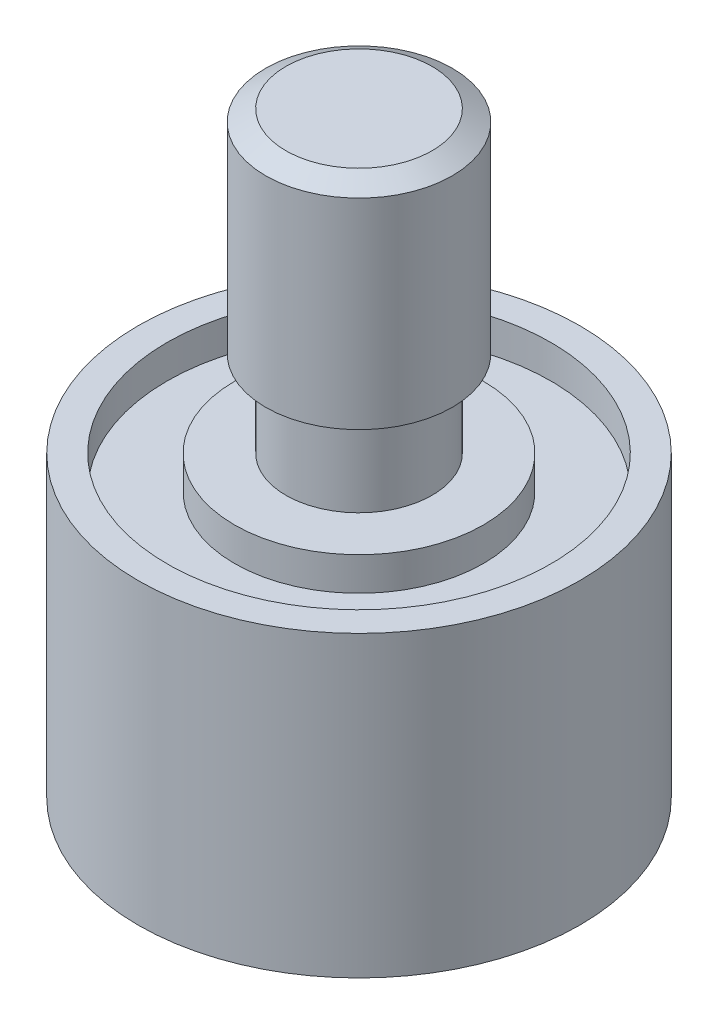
ISO-10303-21;
HEADER;
FILE_DESCRIPTION(('STEP AP214'),'2;1');
FILE_NAME('part.step','',(''),(''),'','','');
FILE_SCHEMA(('AUTOMOTIVE_DESIGN { 1 0 10303 214 1 1 1 1 }'));
ENDSEC;
DATA;
#1=APPLICATION_CONTEXT('core data for automotive mechanical design processes');
#2=APPLICATION_PROTOCOL_DEFINITION('international standard','automotive_design',2000,#1);
#3=PRODUCT_CONTEXT('',#1,'mechanical');
#4=PRODUCT('Part','Part','',(#3));
#5=PRODUCT_RELATED_PRODUCT_CATEGORY('part','',(#4));
#6=PRODUCT_DEFINITION_FORMATION('','',#4);
#7=PRODUCT_DEFINITION_CONTEXT('part definition',#1,'design');
#8=PRODUCT_DEFINITION('design','',#6,#7);
#9=PRODUCT_DEFINITION_SHAPE('','',#8);
#10=(LENGTH_UNIT() NAMED_UNIT(*) SI_UNIT(.MILLI.,.METRE.));
#11=(NAMED_UNIT(*) PLANE_ANGLE_UNIT() SI_UNIT($,.RADIAN.));
#12=(NAMED_UNIT(*) SI_UNIT($,.STERADIAN.) SOLID_ANGLE_UNIT());
#13=UNCERTAINTY_MEASURE_WITH_UNIT(LENGTH_MEASURE(1.E-05),#10,'distance_accuracy_value','');
#14=(GEOMETRIC_REPRESENTATION_CONTEXT(3) GLOBAL_UNCERTAINTY_ASSIGNED_CONTEXT((#13)) GLOBAL_UNIT_ASSIGNED_CONTEXT((#10,
#11,#12)) REPRESENTATION_CONTEXT('',''));
#15=CARTESIAN_POINT('',(0.,0.,0.));
#16=DIRECTION('',(0.,0.,1.));
#17=DIRECTION('',(1.,0.,0.));
#18=AXIS2_PLACEMENT_3D('',#15,#16,#17);
#19=CARTESIAN_POINT('',(3.1115,12.7,0.));
#20=DIRECTION('',(0.,-1.,0.));
#21=DIRECTION('',(1.,0.,0.));
#22=AXIS2_PLACEMENT_3D('',#19,#20,#21);
#23=PLANE('',#22);
#24=CARTESIAN_POINT('',(0.,12.7,0.));
#25=DIRECTION('',(0.,1.,0.));
#26=DIRECTION('',(-1.,0.,0.));
#27=AXIS2_PLACEMENT_3D('',#24,#25,#26);
#28=CIRCLE('',#27,3.1115);
#29=CARTESIAN_POINT('',(-3.1115,12.7,0.));
#30=VERTEX_POINT('',#29);
#31=EDGE_CURVE('E11',#30,#30,#28,.T.);
#32=ORIENTED_EDGE('',*,*,#31,.T.);
#33=EDGE_LOOP('',(#32));
#34=FACE_BOUND('',#33,.T.);
#35=ADVANCED_FACE('F35',(#34),#23,.F.);
#36=CARTESIAN_POINT('',(0.,12.2050664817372,0.));
#37=DIRECTION('',(0.,-1.,0.));
#38=DIRECTION('',(1.,0.,0.));
#39=AXIS2_PLACEMENT_3D('',#36,#37,#38);
#40=CONICAL_SURFACE('',#39,3.96875,1.0471975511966);
#41=ORIENTED_EDGE('',*,*,#31,.F.);
#42=EDGE_LOOP('',(#41));
#43=FACE_BOUND('',#42,.T.);
#44=CARTESIAN_POINT('',(0.,12.2050664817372,0.));
#45=DIRECTION('',(0.,1.,0.));
#46=DIRECTION('',(-1.,0.,0.));
#47=AXIS2_PLACEMENT_3D('',#44,#45,#46);
#48=CIRCLE('',#47,3.96875);
#49=CARTESIAN_POINT('',(-3.96875,12.2050664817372,0.));
#50=VERTEX_POINT('',#49);
#51=EDGE_CURVE('E42',#50,#50,#48,.T.);
#52=ORIENTED_EDGE('',*,*,#51,.T.);
#53=EDGE_LOOP('',(#52));
#54=FACE_BOUND('',#53,.T.);
#55=ADVANCED_FACE('F98',(#43,#54),#40,.T.);
#56=CARTESIAN_POINT('',(0.,0.,0.));
#57=DIRECTION('',(0.,1.,0.));
#58=DIRECTION('',(-1.,0.,0.));
#59=AXIS2_PLACEMENT_3D('',#56,#57,#58);
#60=CYLINDRICAL_SURFACE('',#59,3.96875);
#61=ORIENTED_EDGE('',*,*,#51,.F.);
#62=EDGE_LOOP('',(#61));
#63=FACE_BOUND('',#62,.T.);
#64=CARTESIAN_POINT('',(0.,3.6699335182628,0.));
#65=DIRECTION('',(0.,1.,0.));
#66=DIRECTION('',(-1.,0.,0.));
#67=AXIS2_PLACEMENT_3D('',#64,#65,#66);
#68=CIRCLE('',#67,3.96875);
#69=CARTESIAN_POINT('',(-3.96875,3.6699335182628,0.));
#70=VERTEX_POINT('',#69);
#71=EDGE_CURVE('E93',#70,#70,#68,.T.);
#72=ORIENTED_EDGE('',*,*,#71,.T.);
#73=EDGE_LOOP('',(#72));
#74=FACE_BOUND('',#73,.T.);
#75=ADVANCED_FACE('F100',(#63,#74),#60,.T.);
#76=CARTESIAN_POINT('',(0.,3.175,0.));
#77=DIRECTION('',(0.,1.,0.));
#78=DIRECTION('',(-1.,0.,0.));
#79=AXIS2_PLACEMENT_3D('',#76,#77,#78);
#80=CONICAL_SURFACE('',#79,3.1115,1.0471975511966);
#81=ORIENTED_EDGE('',*,*,#71,.F.);
#82=EDGE_LOOP('',(#81));
#83=FACE_BOUND('',#82,.T.);
#84=CARTESIAN_POINT('',(0.,3.175,0.));
#85=DIRECTION('',(0.,1.,0.));
#86=DIRECTION('',(-1.,0.,0.));
#87=AXIS2_PLACEMENT_3D('',#84,#85,#86);
#88=CIRCLE('',#87,3.1115);
#89=CARTESIAN_POINT('',(-3.1115,3.175,0.));
#90=VERTEX_POINT('',#89);
#91=EDGE_CURVE('E90',#90,#90,#88,.T.);
#92=ORIENTED_EDGE('',*,*,#91,.T.);
#93=EDGE_LOOP('',(#92));
#94=FACE_BOUND('',#93,.T.);
#95=ADVANCED_FACE('F103',(#83,#94),#80,.T.);
#96=CARTESIAN_POINT('',(0.,0.,0.));
#97=DIRECTION('',(0.,1.,0.));
#98=DIRECTION('',(-1.,0.,0.));
#99=AXIS2_PLACEMENT_3D('',#96,#97,#98);
#100=CYLINDRICAL_SURFACE('',#99,3.1115);
#101=ORIENTED_EDGE('',*,*,#91,.F.);
#102=EDGE_LOOP('',(#101));
#103=FACE_BOUND('',#102,.T.);
#104=CARTESIAN_POINT('',(0.,0.,0.));
#105=DIRECTION('',(0.,1.,0.));
#106=DIRECTION('',(-1.,0.,0.));
#107=AXIS2_PLACEMENT_3D('',#104,#105,#106);
#108=CIRCLE('',#107,3.1115);
#109=CARTESIAN_POINT('',(-3.1115,0.,0.));
#110=VERTEX_POINT('',#109);
#111=EDGE_CURVE('E87',#110,#110,#108,.T.);
#112=ORIENTED_EDGE('',*,*,#111,.T.);
#113=EDGE_LOOP('',(#112));
#114=FACE_BOUND('',#113,.T.);
#115=ADVANCED_FACE('F109',(#103,#114),#100,.T.);
#116=CARTESIAN_POINT('',(3.1115,0.,0.));
#117=DIRECTION('',(0.,-1.,0.));
#118=DIRECTION('',(1.,0.,0.));
#119=AXIS2_PLACEMENT_3D('',#116,#117,#118);
#120=PLANE('',#119);
#121=ORIENTED_EDGE('',*,*,#111,.F.);
#122=EDGE_LOOP('',(#121));
#123=FACE_BOUND('',#122,.T.);
#124=CARTESIAN_POINT('',(0.,0.,0.));
#125=DIRECTION('',(0.,1.,0.));
#126=DIRECTION('',(-1.,0.,0.));
#127=AXIS2_PLACEMENT_3D('',#124,#125,#126);
#128=CIRCLE('',#127,5.2959);
#129=CARTESIAN_POINT('',(-5.2959,0.,0.));
#130=VERTEX_POINT('',#129);
#131=EDGE_CURVE('E84',#130,#130,#128,.T.);
#132=ORIENTED_EDGE('',*,*,#131,.T.);
#133=EDGE_LOOP('',(#132));
#134=FACE_BOUND('',#133,.T.);
#135=ADVANCED_FACE('F115',(#123,#134),#120,.F.);
#136=CARTESIAN_POINT('',(0.,0.,0.));
#137=DIRECTION('',(0.,1.,0.));
#138=DIRECTION('',(-1.,0.,0.));
#139=AXIS2_PLACEMENT_3D('',#136,#137,#138);
#140=CYLINDRICAL_SURFACE('',#139,5.2959);
#141=ORIENTED_EDGE('',*,*,#131,.F.);
#142=EDGE_LOOP('',(#141));
#143=FACE_BOUND('',#142,.T.);
#144=CARTESIAN_POINT('',(0.,-1.4224,0.));
#145=DIRECTION('',(0.,1.,0.));
#146=DIRECTION('',(-1.,0.,0.));
#147=AXIS2_PLACEMENT_3D('',#144,#145,#146);
#148=CIRCLE('',#147,5.2959);
#149=CARTESIAN_POINT('',(-5.2959,-1.4224,0.));
#150=VERTEX_POINT('',#149);
#151=EDGE_CURVE('E81',#150,#150,#148,.T.);
#152=ORIENTED_EDGE('',*,*,#151,.T.);
#153=EDGE_LOOP('',(#152));
#154=FACE_BOUND('',#153,.T.);
#155=ADVANCED_FACE('F121',(#143,#154),#140,.T.);
#156=CARTESIAN_POINT('',(5.2959,-1.4224,0.));
#157=DIRECTION('',(0.,-1.,0.));
#158=DIRECTION('',(1.,0.,0.));
#159=AXIS2_PLACEMENT_3D('',#156,#157,#158);
#160=PLANE('',#159);
#161=ORIENTED_EDGE('',*,*,#151,.F.);
#162=EDGE_LOOP('',(#161));
#163=FACE_BOUND('',#162,.T.);
#164=CARTESIAN_POINT('',(0.,-1.4224,0.));
#165=DIRECTION('',(0.,1.,0.));
#166=DIRECTION('',(-1.,0.,0.));
#167=AXIS2_PLACEMENT_3D('',#164,#165,#166);
#168=CIRCLE('',#167,8.1661);
#169=CARTESIAN_POINT('',(-8.1661,-1.4224,0.));
#170=VERTEX_POINT('',#169);
#171=EDGE_CURVE('E78',#170,#170,#168,.T.);
#172=ORIENTED_EDGE('',*,*,#171,.T.);
#173=EDGE_LOOP('',(#172));
#174=FACE_BOUND('',#173,.T.);
#175=ADVANCED_FACE('F127',(#163,#174),#160,.F.);
#176=CARTESIAN_POINT('',(0.,0.,0.));
#177=DIRECTION('',(0.,1.,0.));
#178=DIRECTION('',(-1.,0.,0.));
#179=AXIS2_PLACEMENT_3D('',#176,#177,#178);
#180=CYLINDRICAL_SURFACE('',#179,8.1661);
#181=ORIENTED_EDGE('',*,*,#171,.F.);
#182=EDGE_LOOP('',(#181));
#183=FACE_BOUND('',#182,.T.);
#184=CARTESIAN_POINT('',(0.,0.,0.));
#185=DIRECTION('',(0.,1.,0.));
#186=DIRECTION('',(-1.,0.,0.));
#187=AXIS2_PLACEMENT_3D('',#184,#185,#186);
#188=CIRCLE('',#187,8.1661);
#189=CARTESIAN_POINT('',(-8.1661,0.,0.));
#190=VERTEX_POINT('',#189);
#191=EDGE_CURVE('E75',#190,#190,#188,.T.);
#192=ORIENTED_EDGE('',*,*,#191,.T.);
#193=EDGE_LOOP('',(#192));
#194=FACE_BOUND('',#193,.T.);
#195=ADVANCED_FACE('F133',(#183,#194),#180,.F.);
#196=CARTESIAN_POINT('',(8.1661,0.,0.));
#197=DIRECTION('',(0.,-1.,0.));
#198=DIRECTION('',(1.,0.,0.));
#199=AXIS2_PLACEMENT_3D('',#196,#197,#198);
#200=PLANE('',#199);
#201=ORIENTED_EDGE('',*,*,#191,.F.);
#202=EDGE_LOOP('',(#201));
#203=FACE_BOUND('',#202,.T.);
#204=CARTESIAN_POINT('',(0.,0.,0.));
#205=DIRECTION('',(0.,1.,0.));
#206=DIRECTION('',(-1.,0.,0.));
#207=AXIS2_PLACEMENT_3D('',#204,#205,#206);
#208=CIRCLE('',#207,9.398);
#209=CARTESIAN_POINT('',(-9.398,0.,0.));
#210=VERTEX_POINT('',#209);
#211=EDGE_CURVE('E72',#210,#210,#208,.T.);
#212=ORIENTED_EDGE('',*,*,#211,.T.);
#213=EDGE_LOOP('',(#212));
#214=FACE_BOUND('',#213,.T.);
#215=ADVANCED_FACE('F139',(#203,#214),#200,.F.);
#216=CARTESIAN_POINT('',(0.,0.,0.));
#217=DIRECTION('',(0.,1.,0.));
#218=DIRECTION('',(-1.,0.,0.));
#219=AXIS2_PLACEMENT_3D('',#216,#217,#218);
#220=CYLINDRICAL_SURFACE('',#219,9.398);
#221=ORIENTED_EDGE('',*,*,#211,.F.);
#222=EDGE_LOOP('',(#221));
#223=FACE_BOUND('',#222,.T.);
#224=CARTESIAN_POINT('',(0.,-12.7,0.));
#225=DIRECTION('',(0.,1.,0.));
#226=DIRECTION('',(-1.,0.,0.));
#227=AXIS2_PLACEMENT_3D('',#224,#225,#226);
#228=CIRCLE('',#227,9.398);
#229=CARTESIAN_POINT('',(-9.398,-12.7,0.));
#230=VERTEX_POINT('',#229);
#231=EDGE_CURVE('E69',#230,#230,#228,.T.);
#232=ORIENTED_EDGE('',*,*,#231,.T.);
#233=EDGE_LOOP('',(#232));
#234=FACE_BOUND('',#233,.T.);
#235=ADVANCED_FACE('F145',(#223,#234),#220,.T.);
#236=CARTESIAN_POINT('',(9.398,-12.7,0.));
#237=DIRECTION('',(0.,1.,0.));
#238=DIRECTION('',(-1.,0.,0.));
#239=AXIS2_PLACEMENT_3D('',#236,#237,#238);
#240=PLANE('',#239);
#241=CARTESIAN_POINT('',(6.3246,-12.7,0.));
#242=DIRECTION('',(0.,-1.,0.));
#243=DIRECTION('',(0.,0.,-1.));
#244=AXIS2_PLACEMENT_3D('',#241,#242,#243);
#245=CIRCLE('',#244,1.28904999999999);
#246=CARTESIAN_POINT('',(6.3246,-12.7,-1.28904999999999));
#247=VERTEX_POINT('',#246);
#248=EDGE_CURVE('E59',#247,#247,#245,.T.);
#249=ORIENTED_EDGE('',*,*,#248,.F.);
#250=EDGE_LOOP('',(#249));
#251=FACE_BOUND('',#250,.T.);
#252=CARTESIAN_POINT('',(-6.3246,-12.7,0.));
#253=DIRECTION('',(0.,-1.,0.));
#254=DIRECTION('',(0.,0.,-1.));
#255=AXIS2_PLACEMENT_3D('',#252,#253,#254);
#256=CIRCLE('',#255,1.28904999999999);
#257=CARTESIAN_POINT('',(-6.3246,-12.7,-1.28904999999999));
#258=VERTEX_POINT('',#257);
#259=EDGE_CURVE('E58',#258,#258,#256,.T.);
#260=ORIENTED_EDGE('',*,*,#259,.F.);
#261=EDGE_LOOP('',(#260));
#262=FACE_BOUND('',#261,.T.);
#263=ORIENTED_EDGE('',*,*,#231,.F.);
#264=EDGE_LOOP('',(#263));
#265=FACE_BOUND('',#264,.T.);
#266=ADVANCED_FACE('F151',(#251,#262,#265),#240,.F.);
#267=CARTESIAN_POINT('',(-6.3246,-8.1534,0.));
#268=DIRECTION('',(0.,-1.,0.));
#269=DIRECTION('',(0.,0.,-1.));
#270=AXIS2_PLACEMENT_3D('',#267,#268,#269);
#271=CONICAL_SURFACE('',#270,1.28905,1.02974425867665);
#272=CARTESIAN_POINT('',(-6.3246,-7.37886061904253,0.));
#273=VERTEX_POINT('',#272);
#274=VERTEX_LOOP('',#273);
#275=FACE_BOUND('',#274,.T.);
#276=CARTESIAN_POINT('',(-6.3246,-8.1534,0.));
#277=DIRECTION('',(0.,-1.,0.));
#278=DIRECTION('',(0.,0.,-1.));
#279=AXIS2_PLACEMENT_3D('',#276,#277,#278);
#280=CIRCLE('',#279,1.28905);
#281=CARTESIAN_POINT('',(-6.3246,-8.1534,-1.28905));
#282=VERTEX_POINT('',#281);
#283=EDGE_CURVE('E62',#282,#282,#280,.T.);
#284=ORIENTED_EDGE('',*,*,#283,.T.);
#285=EDGE_LOOP('',(#284));
#286=FACE_BOUND('',#285,.T.);
#287=ADVANCED_FACE('F156',(#275,#286),#271,.F.);
#288=CARTESIAN_POINT('',(-6.3246,-12.7,0.));
#289=DIRECTION('',(0.,-1.,0.));
#290=DIRECTION('',(0.,0.,-1.));
#291=AXIS2_PLACEMENT_3D('',#288,#289,#290);
#292=CYLINDRICAL_SURFACE('',#291,1.28904999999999);
#293=ORIENTED_EDGE('',*,*,#283,.F.);
#294=EDGE_LOOP('',(#293));
#295=FACE_BOUND('',#294,.T.);
#296=ORIENTED_EDGE('',*,*,#259,.T.);
#297=EDGE_LOOP('',(#296));
#298=FACE_BOUND('',#297,.T.);
#299=ADVANCED_FACE('F52',(#295,#298),#292,.F.);
#300=CARTESIAN_POINT('',(6.3246,-8.1534,0.));
#301=DIRECTION('',(0.,-1.,0.));
#302=DIRECTION('',(0.,0.,-1.));
#303=AXIS2_PLACEMENT_3D('',#300,#301,#302);
#304=CONICAL_SURFACE('',#303,1.28905,1.02974425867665);
#305=CARTESIAN_POINT('',(6.3246,-7.37886061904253,0.));
#306=VERTEX_POINT('',#305);
#307=VERTEX_LOOP('',#306);
#308=FACE_BOUND('',#307,.T.);
#309=CARTESIAN_POINT('',(6.3246,-8.1534,0.));
#310=DIRECTION('',(0.,-1.,0.));
#311=DIRECTION('',(0.,0.,-1.));
#312=AXIS2_PLACEMENT_3D('',#309,#310,#311);
#313=CIRCLE('',#312,1.28905);
#314=CARTESIAN_POINT('',(6.3246,-8.1534,-1.28905));
#315=VERTEX_POINT('',#314);
#316=EDGE_CURVE('E56',#315,#315,#313,.T.);
#317=ORIENTED_EDGE('',*,*,#316,.T.);
#318=EDGE_LOOP('',(#317));
#319=FACE_BOUND('',#318,.T.);
#320=ADVANCED_FACE('F48',(#308,#319),#304,.F.);
#321=CARTESIAN_POINT('',(6.3246,-12.7,0.));
#322=DIRECTION('',(0.,-1.,0.));
#323=DIRECTION('',(0.,0.,-1.));
#324=AXIS2_PLACEMENT_3D('',#321,#322,#323);
#325=CYLINDRICAL_SURFACE('',#324,1.28904999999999);
#326=ORIENTED_EDGE('',*,*,#316,.F.);
#327=EDGE_LOOP('',(#326));
#328=FACE_BOUND('',#327,.T.);
#329=ORIENTED_EDGE('',*,*,#248,.T.);
#330=EDGE_LOOP('',(#329));
#331=FACE_BOUND('',#330,.T.);
#332=ADVANCED_FACE('F51',(#328,#331),#325,.F.);
#333=CLOSED_SHELL('',(#35,#55,#75,#95,#115,#135,#155,#175,#195,#215,#235,#266,#287,#299,#320,#332));
#334=MANIFOLD_SOLID_BREP('B2',#333);
#335=ADVANCED_BREP_SHAPE_REPRESENTATION('',(#18,#334),#14);
#336=SHAPE_DEFINITION_REPRESENTATION(#9,#335);
ENDSEC;
END-ISO-10303-21;
